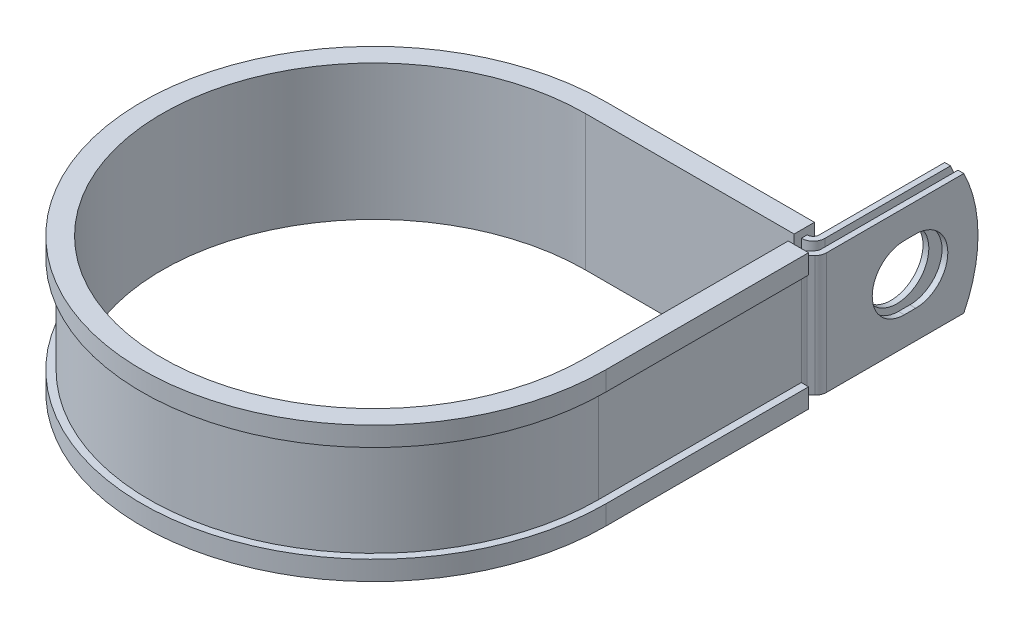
ISO-10303-21;
HEADER;
FILE_DESCRIPTION(('STEP AP214'),'2;1');
FILE_NAME('part.step','',(''),(''),'','','');
FILE_SCHEMA(('AUTOMOTIVE_DESIGN { 1 0 10303 214 1 1 1 1 }'));
ENDSEC;
DATA;
#1=APPLICATION_CONTEXT('core data for automotive mechanical design processes');
#2=APPLICATION_PROTOCOL_DEFINITION('international standard','automotive_design',2000,#1);
#3=PRODUCT_CONTEXT('',#1,'mechanical');
#4=PRODUCT('Part','Part','',(#3));
#5=PRODUCT_RELATED_PRODUCT_CATEGORY('part','',(#4));
#6=PRODUCT_DEFINITION_FORMATION('','',#4);
#7=PRODUCT_DEFINITION_CONTEXT('part definition',#1,'design');
#8=PRODUCT_DEFINITION('design','',#6,#7);
#9=PRODUCT_DEFINITION_SHAPE('','',#8);
#10=(LENGTH_UNIT() NAMED_UNIT(*) SI_UNIT(.MILLI.,.METRE.));
#11=(NAMED_UNIT(*) PLANE_ANGLE_UNIT() SI_UNIT($,.RADIAN.));
#12=(NAMED_UNIT(*) SI_UNIT($,.STERADIAN.) SOLID_ANGLE_UNIT());
#13=UNCERTAINTY_MEASURE_WITH_UNIT(LENGTH_MEASURE(1.E-05),#10,'distance_accuracy_value','');
#14=(GEOMETRIC_REPRESENTATION_CONTEXT(3) GLOBAL_UNCERTAINTY_ASSIGNED_CONTEXT((#13)) GLOBAL_UNIT_ASSIGNED_CONTEXT((#10,
#11,#12)) REPRESENTATION_CONTEXT('',''));
#15=CARTESIAN_POINT('',(0.,0.,0.));
#16=DIRECTION('',(0.,0.,1.));
#17=DIRECTION('',(1.,0.,0.));
#18=AXIS2_PLACEMENT_3D('',#15,#16,#17);
#19=CARTESIAN_POINT('',(46.6522698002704,-12.7,-45.974));
#20=DIRECTION('',(0.,1.,0.));
#21=DIRECTION('',(1.,0.,0.));
#22=AXIS2_PLACEMENT_3D('',#19,#20,#21);
#23=PLANE('',#22);
#24=DIRECTION('',(0.,0.,-1.));
#25=VECTOR('',#24,1.);
#26=CARTESIAN_POINT('',(43.8074698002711,-12.7,-45.974));
#27=LINE('',#26,#25);
#28=CARTESIAN_POINT('',(43.8074698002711,-12.7,-45.974));
#29=VERTEX_POINT('',#28);
#30=CARTESIAN_POINT('',(43.8074698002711,-12.7,-47.1932));
#31=VERTEX_POINT('',#30);
#32=EDGE_CURVE('E524',#29,#31,#27,.T.);
#33=ORIENTED_EDGE('',*,*,#32,.T.);
#34=DIRECTION('',(1.,0.,0.));
#35=VECTOR('',#34,1.);
#36=CARTESIAN_POINT('',(0.,-12.7,-47.1932));
#37=LINE('',#36,#35);
#38=CARTESIAN_POINT('',(43.8582698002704,-12.7,-47.1932));
#39=VERTEX_POINT('',#38);
#40=EDGE_CURVE('E411',#39,#31,#37,.F.);
#41=ORIENTED_EDGE('',*,*,#40,.F.);
#42=CARTESIAN_POINT('',(43.8582698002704,-12.7,-48.4124));
#43=DIRECTION('',(0.,1.,0.));
#44=DIRECTION('',(1.,0.,0.));
#45=AXIS2_PLACEMENT_3D('',#42,#43,#44);
#46=CIRCLE('',#45,1.2192);
#47=CARTESIAN_POINT('',(45.0774698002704,-12.7,-48.4124));
#48=VERTEX_POINT('',#47);
#49=EDGE_CURVE('E409',#48,#39,#46,.F.);
#50=ORIENTED_EDGE('',*,*,#49,.F.);
#51=DIRECTION('',(0.,0.,1.));
#52=VECTOR('',#51,1.);
#53=CARTESIAN_POINT('',(45.0774698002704,-12.7,-77.7748));
#54=LINE('',#53,#52);
#55=CARTESIAN_POINT('',(45.0774698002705,-12.7,-74.7974683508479));
#56=VERTEX_POINT('',#55);
#57=EDGE_CURVE('E407',#56,#48,#54,.T.);
#58=ORIENTED_EDGE('',*,*,#57,.F.);
#59=DIRECTION('',(-1.,0.,0.));
#60=VECTOR('',#59,1.);
#61=CARTESIAN_POINT('',(49.0906698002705,-12.7,-74.7974683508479));
#62=LINE('',#61,#60);
#63=CARTESIAN_POINT('',(46.2966698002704,-12.7,-74.7974683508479));
#64=VERTEX_POINT('',#63);
#65=EDGE_CURVE('E12',#64,#56,#62,.T.);
#66=ORIENTED_EDGE('',*,*,#65,.F.);
#67=DIRECTION('',(0.,0.,1.));
#68=VECTOR('',#67,1.);
#69=CARTESIAN_POINT('',(46.2966698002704,-12.7,-77.7748));
#70=LINE('',#69,#68);
#71=CARTESIAN_POINT('',(46.2966698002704,-12.7,-48.4124));
#72=VERTEX_POINT('',#71);
#73=EDGE_CURVE('E405',#64,#72,#70,.T.);
#74=ORIENTED_EDGE('',*,*,#73,.T.);
#75=CARTESIAN_POINT('',(43.8582698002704,-12.7,-48.4124));
#76=DIRECTION('',(0.,-1.,0.));
#77=DIRECTION('',(0.,0.,1.));
#78=AXIS2_PLACEMENT_3D('',#75,#76,#77);
#79=CIRCLE('',#78,2.4384);
#80=CARTESIAN_POINT('',(43.8582698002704,-12.7,-45.974));
#81=VERTEX_POINT('',#80);
#82=EDGE_CURVE('E402',#72,#81,#79,.T.);
#83=ORIENTED_EDGE('',*,*,#82,.T.);
#84=DIRECTION('',(-1.,0.,0.));
#85=VECTOR('',#84,1.);
#86=CARTESIAN_POINT('',(0.,-12.7,-45.974));
#87=LINE('',#86,#85);
#88=EDGE_CURVE('E399',#81,#29,#87,.T.);
#89=ORIENTED_EDGE('',*,*,#88,.T.);
#90=EDGE_LOOP('',(#33,#41,#50,#58,#66,#74,#83,#89));
#91=FACE_BOUND('',#90,.T.);
#92=ADVANCED_FACE('F55',(#91),#23,.F.);
#93=CARTESIAN_POINT('',(46.6522698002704,12.7,-45.974));
#94=DIRECTION('',(0.,1.,0.));
#95=DIRECTION('',(1.,0.,0.));
#96=AXIS2_PLACEMENT_3D('',#93,#94,#95);
#97=PLANE('',#96);
#98=DIRECTION('',(1.,0.,0.));
#99=VECTOR('',#98,1.);
#100=CARTESIAN_POINT('',(0.,12.7,-47.1932));
#101=LINE('',#100,#99);
#102=CARTESIAN_POINT('',(43.8582698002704,12.7,-47.1932));
#103=VERTEX_POINT('',#102);
#104=CARTESIAN_POINT('',(43.8074698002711,12.7,-47.1932));
#105=VERTEX_POINT('',#104);
#106=EDGE_CURVE('E369',#103,#105,#101,.F.);
#107=ORIENTED_EDGE('',*,*,#106,.T.);
#108=DIRECTION('',(0.,0.,1.));
#109=VECTOR('',#108,1.);
#110=CARTESIAN_POINT('',(43.8074698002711,12.7,-47.1932));
#111=LINE('',#110,#109);
#112=CARTESIAN_POINT('',(43.8074698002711,12.7,-45.974));
#113=VERTEX_POINT('',#112);
#114=EDGE_CURVE('E518',#105,#113,#111,.T.);
#115=ORIENTED_EDGE('',*,*,#114,.T.);
#116=DIRECTION('',(-1.,0.,0.));
#117=VECTOR('',#116,1.);
#118=CARTESIAN_POINT('',(0.,12.7,-45.974));
#119=LINE('',#118,#117);
#120=CARTESIAN_POINT('',(43.8582698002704,12.7,-45.974));
#121=VERTEX_POINT('',#120);
#122=EDGE_CURVE('E626',#121,#113,#119,.T.);
#123=ORIENTED_EDGE('',*,*,#122,.F.);
#124=CARTESIAN_POINT('',(43.8582698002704,12.7,-48.4124));
#125=DIRECTION('',(0.,-1.,0.));
#126=DIRECTION('',(0.,0.,1.));
#127=AXIS2_PLACEMENT_3D('',#124,#125,#126);
#128=CIRCLE('',#127,2.4384);
#129=CARTESIAN_POINT('',(46.2966698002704,12.7,-48.4124));
#130=VERTEX_POINT('',#129);
#131=EDGE_CURVE('E371',#130,#121,#128,.T.);
#132=ORIENTED_EDGE('',*,*,#131,.F.);
#133=DIRECTION('',(0.,0.,1.));
#134=VECTOR('',#133,1.);
#135=CARTESIAN_POINT('',(46.2966698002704,12.7,-77.7748));
#136=LINE('',#135,#134);
#137=CARTESIAN_POINT('',(46.2966698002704,12.7,-74.7974683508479));
#138=VERTEX_POINT('',#137);
#139=EDGE_CURVE('E362',#138,#130,#136,.T.);
#140=ORIENTED_EDGE('',*,*,#139,.F.);
#141=DIRECTION('',(-1.,0.,0.));
#142=VECTOR('',#141,1.);
#143=CARTESIAN_POINT('',(49.0906698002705,12.7,-74.7974683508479));
#144=LINE('',#143,#142);
#145=CARTESIAN_POINT('',(45.0774698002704,12.7,-74.7974683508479));
#146=VERTEX_POINT('',#145);
#147=EDGE_CURVE('E63',#138,#146,#144,.T.);
#148=ORIENTED_EDGE('',*,*,#147,.T.);
#149=DIRECTION('',(0.,0.,1.));
#150=VECTOR('',#149,1.);
#151=CARTESIAN_POINT('',(45.0774698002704,12.7,-77.7748));
#152=LINE('',#151,#150);
#153=CARTESIAN_POINT('',(45.0774698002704,12.7,-48.4124));
#154=VERTEX_POINT('',#153);
#155=EDGE_CURVE('E359',#146,#154,#152,.T.);
#156=ORIENTED_EDGE('',*,*,#155,.T.);
#157=CARTESIAN_POINT('',(43.8582698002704,12.7,-48.4124));
#158=DIRECTION('',(0.,1.,0.));
#159=DIRECTION('',(1.,0.,0.));
#160=AXIS2_PLACEMENT_3D('',#157,#158,#159);
#161=CIRCLE('',#160,1.2192);
#162=EDGE_CURVE('E367',#154,#103,#161,.F.);
#163=ORIENTED_EDGE('',*,*,#162,.T.);
#164=EDGE_LOOP('',(#107,#115,#123,#132,#140,#148,#156,#163));
#165=FACE_BOUND('',#164,.T.);
#166=ADVANCED_FACE('F358',(#165),#97,.T.);
#167=CARTESIAN_POINT('',(0.,12.7,-45.974));
#168=DIRECTION('',(0.,0.,1.));
#169=DIRECTION('',(1.,0.,0.));
#170=AXIS2_PLACEMENT_3D('',#167,#168,#169);
#171=PLANE('',#170);
#172=ORIENTED_EDGE('',*,*,#122,.T.);
#173=DIRECTION('',(0.,-1.,0.));
#174=VECTOR('',#173,1.);
#175=CARTESIAN_POINT('',(43.8074698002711,12.7,-45.974));
#176=LINE('',#175,#174);
#177=EDGE_CURVE('E521',#113,#29,#176,.T.);
#178=ORIENTED_EDGE('',*,*,#177,.T.);
#179=ORIENTED_EDGE('',*,*,#88,.F.);
#180=DIRECTION('',(0.,-1.,0.));
#181=VECTOR('',#180,1.);
#182=CARTESIAN_POINT('',(43.8582698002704,12.7,-45.974));
#183=LINE('',#182,#181);
#184=EDGE_CURVE('E345',#121,#81,#183,.T.);
#185=ORIENTED_EDGE('',*,*,#184,.F.);
#186=EDGE_LOOP('',(#172,#178,#179,#185));
#187=FACE_BOUND('',#186,.T.);
#188=ADVANCED_FACE('F636',(#187),#171,.T.);
#189=CARTESIAN_POINT('',(49.0906698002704,12.7,-45.974));
#190=DIRECTION('',(-1.,0.,0.));
#191=DIRECTION('',(0.,0.,1.));
#192=AXIS2_PLACEMENT_3D('',#189,#190,#191);
#193=PLANE('',#192);
#194=CARTESIAN_POINT('',(49.0906698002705,0.,-64.6937999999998));
#195=DIRECTION('',(1.,0.,0.));
#196=DIRECTION('',(0.,0.,-1.));
#197=AXIS2_PLACEMENT_3D('',#194,#195,#196);
#198=CIRCLE('',#197,6.7437);
#199=CARTESIAN_POINT('',(49.0906698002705,-6.7437,-64.6938000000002));
#200=VERTEX_POINT('',#199);
#201=CARTESIAN_POINT('',(49.0906698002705,6.7437,-64.6938000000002));
#202=VERTEX_POINT('',#201);
#203=EDGE_CURVE('E581',#200,#202,#198,.T.);
#204=ORIENTED_EDGE('',*,*,#203,.F.);
#205=DIRECTION('',(0.,0.,-1.));
#206=VECTOR('',#205,1.);
#207=CARTESIAN_POINT('',(49.0906698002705,-6.7437,-62.3061999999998));
#208=LINE('',#207,#206);
#209=CARTESIAN_POINT('',(49.0906698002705,-6.7437,-62.3061999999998));
#210=VERTEX_POINT('',#209);
#211=EDGE_CURVE('E584',#210,#200,#208,.T.);
#212=ORIENTED_EDGE('',*,*,#211,.F.);
#213=CARTESIAN_POINT('',(49.0906698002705,0.,-62.3061999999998));
#214=DIRECTION('',(1.,0.,0.));
#215=DIRECTION('',(0.,0.,-1.));
#216=AXIS2_PLACEMENT_3D('',#213,#214,#215);
#217=CIRCLE('',#216,6.7437);
#218=CARTESIAN_POINT('',(49.0906698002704,6.7437,-62.3061999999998));
#219=VERTEX_POINT('',#218);
#220=EDGE_CURVE('E577',#219,#210,#217,.T.);
#221=ORIENTED_EDGE('',*,*,#220,.F.);
#222=DIRECTION('',(0.,0.,1.));
#223=VECTOR('',#222,1.);
#224=CARTESIAN_POINT('',(49.0906698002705,6.7437,-62.3061999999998));
#225=LINE('',#224,#223);
#226=EDGE_CURVE('E578',#202,#219,#225,.T.);
#227=ORIENTED_EDGE('',*,*,#226,.F.);
#228=EDGE_LOOP('',(#204,#212,#221,#227));
#229=FACE_BOUND('',#228,.T.);
#230=DIRECTION('',(0.,0.,-1.));
#231=VECTOR('',#230,1.);
#232=CARTESIAN_POINT('',(49.0906698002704,-12.7,-45.974));
#233=LINE('',#232,#231);
#234=CARTESIAN_POINT('',(49.0906698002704,-12.7,-45.974));
#235=VERTEX_POINT('',#234);
#236=CARTESIAN_POINT('',(49.0906698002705,-12.7,-74.7974683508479));
#237=VERTEX_POINT('',#236);
#238=EDGE_CURVE('E383',#235,#237,#233,.T.);
#239=ORIENTED_EDGE('',*,*,#238,.T.);
#240=CARTESIAN_POINT('',(49.0906698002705,0.,-49.1998));
#241=DIRECTION('',(-1.,0.,0.));
#242=DIRECTION('',(0.,0.,1.));
#243=AXIS2_PLACEMENT_3D('',#240,#241,#242);
#244=CIRCLE('',#243,28.575);
#245=CARTESIAN_POINT('',(49.0906698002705,12.7,-74.7974683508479));
#246=VERTEX_POINT('',#245);
#247=EDGE_CURVE('E569',#246,#237,#244,.T.);
#248=ORIENTED_EDGE('',*,*,#247,.F.);
#249=DIRECTION('',(0.,0.,-1.));
#250=VECTOR('',#249,1.);
#251=CARTESIAN_POINT('',(49.0906698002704,12.7,-45.974));
#252=LINE('',#251,#250);
#253=CARTESIAN_POINT('',(49.0906698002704,12.7,-45.974));
#254=VERTEX_POINT('',#253);
#255=EDGE_CURVE('E420',#254,#246,#252,.T.);
#256=ORIENTED_EDGE('',*,*,#255,.F.);
#257=DIRECTION('',(0.,-1.,0.));
#258=VECTOR('',#257,1.);
#259=CARTESIAN_POINT('',(49.0906698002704,12.7,-45.974));
#260=LINE('',#259,#258);
#261=EDGE_CURVE('E382',#254,#235,#260,.T.);
#262=ORIENTED_EDGE('',*,*,#261,.T.);
#263=EDGE_LOOP('',(#239,#248,#256,#262));
#264=FACE_BOUND('',#263,.T.);
#265=ADVANCED_FACE('F57',(#229,#264),#193,.F.);
#266=CARTESIAN_POINT('',(47.8714698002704,12.7,-45.974));
#267=DIRECTION('',(-1.,0.,0.));
#268=DIRECTION('',(0.,0.,1.));
#269=AXIS2_PLACEMENT_3D('',#266,#267,#268);
#270=PLANE('',#269);
#271=DIRECTION('',(0.,0.,-1.));
#272=VECTOR('',#271,1.);
#273=CARTESIAN_POINT('',(47.8714698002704,-6.7437,-62.3061999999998));
#274=LINE('',#273,#272);
#275=CARTESIAN_POINT('',(47.8714698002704,-6.7437,-62.3061999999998));
#276=VERTEX_POINT('',#275);
#277=CARTESIAN_POINT('',(47.8714698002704,-6.7437,-64.6938000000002));
#278=VERTEX_POINT('',#277);
#279=EDGE_CURVE('E580',#276,#278,#274,.T.);
#280=ORIENTED_EDGE('',*,*,#279,.T.);
#281=CARTESIAN_POINT('',(47.8714698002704,0.,-64.6937999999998));
#282=DIRECTION('',(-1.,0.,0.));
#283=DIRECTION('',(0.,0.,1.));
#284=AXIS2_PLACEMENT_3D('',#281,#282,#283);
#285=CIRCLE('',#284,6.7437);
#286=CARTESIAN_POINT('',(47.8714698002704,6.7437,-64.6938000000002));
#287=VERTEX_POINT('',#286);
#288=EDGE_CURVE('E601',#278,#287,#285,.F.);
#289=ORIENTED_EDGE('',*,*,#288,.T.);
#290=DIRECTION('',(0.,0.,1.));
#291=VECTOR('',#290,1.);
#292=CARTESIAN_POINT('',(47.8714698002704,6.7437,-62.3061999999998));
#293=LINE('',#292,#291);
#294=CARTESIAN_POINT('',(47.8714698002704,6.7437,-62.3061999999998));
#295=VERTEX_POINT('',#294);
#296=EDGE_CURVE('E597',#287,#295,#293,.T.);
#297=ORIENTED_EDGE('',*,*,#296,.T.);
#298=CARTESIAN_POINT('',(47.8714698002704,0.,-62.3061999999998));
#299=DIRECTION('',(-1.,0.,0.));
#300=DIRECTION('',(0.,0.,1.));
#301=AXIS2_PLACEMENT_3D('',#298,#299,#300);
#302=CIRCLE('',#301,6.7437);
#303=EDGE_CURVE('E592',#295,#276,#302,.F.);
#304=ORIENTED_EDGE('',*,*,#303,.T.);
#305=EDGE_LOOP('',(#280,#289,#297,#304));
#306=FACE_BOUND('',#305,.T.);
#307=CARTESIAN_POINT('',(47.8714698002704,0.,-49.1998));
#308=DIRECTION('',(-1.,0.,0.));
#309=DIRECTION('',(0.,0.,1.));
#310=AXIS2_PLACEMENT_3D('',#307,#308,#309);
#311=CIRCLE('',#310,28.575);
#312=CARTESIAN_POINT('',(47.8714698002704,12.7,-74.7974683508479));
#313=VERTEX_POINT('',#312);
#314=CARTESIAN_POINT('',(47.8714698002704,-12.7,-74.7974683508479));
#315=VERTEX_POINT('',#314);
#316=EDGE_CURVE('E77',#313,#315,#311,.T.);
#317=ORIENTED_EDGE('',*,*,#316,.T.);
#318=DIRECTION('',(0.,0.,-1.));
#319=VECTOR('',#318,1.);
#320=CARTESIAN_POINT('',(47.8714698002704,-12.7,-45.974));
#321=LINE('',#320,#319);
#322=CARTESIAN_POINT('',(47.8714698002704,-12.7,-45.974));
#323=VERTEX_POINT('',#322);
#324=EDGE_CURVE('E386',#323,#315,#321,.T.);
#325=ORIENTED_EDGE('',*,*,#324,.F.);
#326=DIRECTION('',(0.,-1.,0.));
#327=VECTOR('',#326,1.);
#328=CARTESIAN_POINT('',(47.8714698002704,12.7,-45.974));
#329=LINE('',#328,#327);
#330=CARTESIAN_POINT('',(47.8714698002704,12.7,-45.974));
#331=VERTEX_POINT('',#330);
#332=EDGE_CURVE('E353',#331,#323,#329,.T.);
#333=ORIENTED_EDGE('',*,*,#332,.F.);
#334=DIRECTION('',(0.,0.,-1.));
#335=VECTOR('',#334,1.);
#336=CARTESIAN_POINT('',(47.8714698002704,12.7,-45.974));
#337=LINE('',#336,#335);
#338=EDGE_CURVE('E616',#331,#313,#337,.T.);
#339=ORIENTED_EDGE('',*,*,#338,.T.);
#340=EDGE_LOOP('',(#317,#325,#333,#339));
#341=FACE_BOUND('',#340,.T.);
#342=ADVANCED_FACE('F690',(#306,#341),#270,.T.);
#343=CARTESIAN_POINT('',(46.2966698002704,12.7,-77.7748));
#344=DIRECTION('',(1.,0.,0.));
#345=DIRECTION('',(0.,0.,-1.));
#346=AXIS2_PLACEMENT_3D('',#343,#344,#345);
#347=PLANE('',#346);
#348=CARTESIAN_POINT('',(46.2966698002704,0.,-63.5));
#349=DIRECTION('',(1.,0.,0.));
#350=DIRECTION('',(0.,0.,-1.));
#351=AXIS2_PLACEMENT_3D('',#348,#349,#350);
#352=CIRCLE('',#351,6.74369999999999);
#353=CARTESIAN_POINT('',(46.2966698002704,0.,-70.2437));
#354=VERTEX_POINT('',#353);
#355=EDGE_CURVE('E387',#354,#354,#352,.F.);
#356=ORIENTED_EDGE('',*,*,#355,.T.);
#357=EDGE_LOOP('',(#356));
#358=FACE_BOUND('',#357,.T.);
#359=ORIENTED_EDGE('',*,*,#73,.F.);
#360=CARTESIAN_POINT('',(46.2966698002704,0.,-49.1998));
#361=DIRECTION('',(1.,0.,0.));
#362=DIRECTION('',(0.,0.,-1.));
#363=AXIS2_PLACEMENT_3D('',#360,#361,#362);
#364=CIRCLE('',#363,28.575);
#365=EDGE_CURVE('E574',#64,#138,#364,.T.);
#366=ORIENTED_EDGE('',*,*,#365,.T.);
#367=ORIENTED_EDGE('',*,*,#139,.T.);
#368=DIRECTION('',(0.,-1.,0.));
#369=VECTOR('',#368,1.);
#370=CARTESIAN_POINT('',(46.2966698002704,12.7,-48.4124));
#371=LINE('',#370,#369);
#372=EDGE_CURVE('E342',#130,#72,#371,.T.);
#373=ORIENTED_EDGE('',*,*,#372,.T.);
#374=EDGE_LOOP('',(#359,#366,#367,#373));
#375=FACE_BOUND('',#374,.T.);
#376=ADVANCED_FACE('F642',(#358,#375),#347,.T.);
#377=CARTESIAN_POINT('',(45.0774698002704,12.7,-77.7748));
#378=DIRECTION('',(1.,0.,0.));
#379=DIRECTION('',(0.,0.,-1.));
#380=AXIS2_PLACEMENT_3D('',#377,#378,#379);
#381=PLANE('',#380);
#382=CARTESIAN_POINT('',(45.0774698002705,0.,-63.5));
#383=DIRECTION('',(-1.,0.,0.));
#384=DIRECTION('',(0.,0.,1.));
#385=AXIS2_PLACEMENT_3D('',#382,#383,#384);
#386=CIRCLE('',#385,6.74369999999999);
#387=CARTESIAN_POINT('',(45.0774698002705,0.,-56.7563));
#388=VERTEX_POINT('',#387);
#389=EDGE_CURVE('E609',#388,#388,#386,.T.);
#390=ORIENTED_EDGE('',*,*,#389,.F.);
#391=EDGE_LOOP('',(#390));
#392=FACE_BOUND('',#391,.T.);
#393=CARTESIAN_POINT('',(45.0774698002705,0.,-49.1998));
#394=DIRECTION('',(-1.,0.,0.));
#395=DIRECTION('',(0.,0.,1.));
#396=AXIS2_PLACEMENT_3D('',#393,#394,#395);
#397=CIRCLE('',#396,28.575);
#398=EDGE_CURVE('E69',#146,#56,#397,.T.);
#399=ORIENTED_EDGE('',*,*,#398,.T.);
#400=ORIENTED_EDGE('',*,*,#57,.T.);
#401=DIRECTION('',(0.,-1.,0.));
#402=VECTOR('',#401,1.);
#403=CARTESIAN_POINT('',(45.0774698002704,12.7,-48.4124));
#404=LINE('',#403,#402);
#405=EDGE_CURVE('E339',#154,#48,#404,.T.);
#406=ORIENTED_EDGE('',*,*,#405,.F.);
#407=ORIENTED_EDGE('',*,*,#155,.F.);
#408=EDGE_LOOP('',(#399,#400,#406,#407));
#409=FACE_BOUND('',#408,.T.);
#410=ADVANCED_FACE('F365',(#392,#409),#381,.F.);
#411=CARTESIAN_POINT('',(48.4124,-12.7,-42.5615026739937));
#412=DIRECTION('',(0.,1.,0.));
#413=DIRECTION('',(1.,0.,0.));
#414=AXIS2_PLACEMENT_3D('',#411,#412,#413);
#415=CIRCLE('',#414,1.2192);
#416=CARTESIAN_POINT('',(47.1932,-12.7,-42.5615026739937));
#417=VERTEX_POINT('',#416);
#418=CARTESIAN_POINT('',(47.5502954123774,-12.7,-43.4236072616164));
#419=VERTEX_POINT('',#418);
#420=EDGE_CURVE('E414',#417,#419,#415,.F.);
#421=ORIENTED_EDGE('',*,*,#420,.F.);
#422=DIRECTION('',(1.,0.,0.));
#423=VECTOR('',#422,1.);
#424=CARTESIAN_POINT('',(45.974,-12.7,-42.5615026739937));
#425=LINE('',#424,#423);
#426=CARTESIAN_POINT('',(45.974,-12.7,-42.5615026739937));
#427=VERTEX_POINT('',#426);
#428=EDGE_CURVE('E452',#427,#417,#425,.T.);
#429=ORIENTED_EDGE('',*,*,#428,.F.);
#430=CARTESIAN_POINT('',(48.4124,-12.7,-42.5615026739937));
#431=DIRECTION('',(0.,-1.,0.));
#432=DIRECTION('',(0.,0.,1.));
#433=AXIS2_PLACEMENT_3D('',#430,#431,#432);
#434=CIRCLE('',#433,2.4384);
#435=CARTESIAN_POINT('',(46.6881908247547,-12.7,-44.285711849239));
#436=VERTEX_POINT('',#435);
#437=EDGE_CURVE('E396',#427,#436,#434,.T.);
#438=ORIENTED_EDGE('',*,*,#437,.T.);
#439=DIRECTION('',(0.707106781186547,0.,-0.707106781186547));
#440=VECTOR('',#439,1.);
#441=CARTESIAN_POINT('',(46.6881908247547,-12.7,-44.285711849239));
#442=LINE('',#441,#440);
#443=CARTESIAN_POINT('',(47.5143743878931,-12.7,-45.1118954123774));
#444=VERTEX_POINT('',#443);
#445=EDGE_CURVE('E393',#436,#444,#442,.T.);
#446=ORIENTED_EDGE('',*,*,#445,.T.);
#447=CARTESIAN_POINT('',(46.6522698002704,-12.7,-45.974));
#448=DIRECTION('',(0.,1.,0.));
#449=DIRECTION('',(0.,0.,1.));
#450=AXIS2_PLACEMENT_3D('',#447,#448,#449);
#451=CIRCLE('',#450,1.2192);
#452=EDGE_CURVE('E390',#444,#323,#451,.T.);
#453=ORIENTED_EDGE('',*,*,#452,.T.);
#454=ORIENTED_EDGE('',*,*,#324,.T.);
#455=DIRECTION('',(-1.,0.,0.));
#456=VECTOR('',#455,1.);
#457=CARTESIAN_POINT('',(49.0906698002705,-12.7,-74.7974683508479));
#458=LINE('',#457,#456);
#459=EDGE_CURVE('E567',#237,#315,#458,.T.);
#460=ORIENTED_EDGE('',*,*,#459,.F.);
#461=ORIENTED_EDGE('',*,*,#238,.F.);
#462=CARTESIAN_POINT('',(46.6522698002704,-12.7,-45.974));
#463=DIRECTION('',(0.,1.,0.));
#464=DIRECTION('',(1.,0.,0.));
#465=AXIS2_PLACEMENT_3D('',#462,#463,#464);
#466=CIRCLE('',#465,2.4384);
#467=CARTESIAN_POINT('',(48.3764789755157,-12.7,-44.2497908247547));
#468=VERTEX_POINT('',#467);
#469=EDGE_CURVE('E418',#468,#235,#466,.T.);
#470=ORIENTED_EDGE('',*,*,#469,.F.);
#471=DIRECTION('',(0.707106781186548,0.,-0.707106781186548));
#472=VECTOR('',#471,1.);
#473=CARTESIAN_POINT('',(47.5502954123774,-12.7,-43.4236072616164));
#474=LINE('',#473,#472);
#475=EDGE_CURVE('E416',#419,#468,#474,.T.);
#476=ORIENTED_EDGE('',*,*,#475,.F.);
#477=EDGE_LOOP('',(#421,#429,#438,#446,#453,#454,#460,#461,#470,#476));
#478=FACE_BOUND('',#477,.T.);
#479=ADVANCED_FACE('F676',(#478),#23,.F.);
#480=DIRECTION('',(-1.,0.,0.));
#481=VECTOR('',#480,1.);
#482=CARTESIAN_POINT('',(47.1932,12.7,-42.5615026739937));
#483=LINE('',#482,#481);
#484=CARTESIAN_POINT('',(47.1932,12.7,-42.5615026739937));
#485=VERTEX_POINT('',#484);
#486=CARTESIAN_POINT('',(45.974,12.7,-42.5615026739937));
#487=VERTEX_POINT('',#486);
#488=EDGE_CURVE('E441',#485,#487,#483,.T.);
#489=ORIENTED_EDGE('',*,*,#488,.F.);
#490=CARTESIAN_POINT('',(48.4124,12.7,-42.5615026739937));
#491=DIRECTION('',(0.,1.,0.));
#492=DIRECTION('',(1.,0.,0.));
#493=AXIS2_PLACEMENT_3D('',#490,#491,#492);
#494=CIRCLE('',#493,1.2192);
#495=CARTESIAN_POINT('',(47.5502954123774,12.7,-43.4236072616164));
#496=VERTEX_POINT('',#495);
#497=EDGE_CURVE('E376',#485,#496,#494,.F.);
#498=ORIENTED_EDGE('',*,*,#497,.T.);
#499=DIRECTION('',(0.707106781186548,0.,-0.707106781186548));
#500=VECTOR('',#499,1.);
#501=CARTESIAN_POINT('',(47.5502954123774,12.7,-43.4236072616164));
#502=LINE('',#501,#500);
#503=CARTESIAN_POINT('',(48.3764789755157,12.7,-44.2497908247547));
#504=VERTEX_POINT('',#503);
#505=EDGE_CURVE('E378',#496,#504,#502,.T.);
#506=ORIENTED_EDGE('',*,*,#505,.T.);
#507=CARTESIAN_POINT('',(46.6522698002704,12.7,-45.974));
#508=DIRECTION('',(0.,1.,0.));
#509=DIRECTION('',(1.,0.,0.));
#510=AXIS2_PLACEMENT_3D('',#507,#508,#509);
#511=CIRCLE('',#510,2.4384);
#512=EDGE_CURVE('E380',#504,#254,#511,.T.);
#513=ORIENTED_EDGE('',*,*,#512,.T.);
#514=ORIENTED_EDGE('',*,*,#255,.T.);
#515=DIRECTION('',(-1.,0.,0.));
#516=VECTOR('',#515,1.);
#517=CARTESIAN_POINT('',(49.0906698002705,12.7,-74.7974683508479));
#518=LINE('',#517,#516);
#519=EDGE_CURVE('E571',#246,#313,#518,.T.);
#520=ORIENTED_EDGE('',*,*,#519,.T.);
#521=ORIENTED_EDGE('',*,*,#338,.F.);
#522=CARTESIAN_POINT('',(46.6522698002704,12.7,-45.974));
#523=DIRECTION('',(0.,1.,0.));
#524=DIRECTION('',(0.,0.,1.));
#525=AXIS2_PLACEMENT_3D('',#522,#523,#524);
#526=CIRCLE('',#525,1.2192);
#527=CARTESIAN_POINT('',(47.5143743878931,12.7,-45.1118954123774));
#528=VERTEX_POINT('',#527);
#529=EDGE_CURVE('E619',#528,#331,#526,.T.);
#530=ORIENTED_EDGE('',*,*,#529,.F.);
#531=DIRECTION('',(0.707106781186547,0.,-0.707106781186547));
#532=VECTOR('',#531,1.);
#533=CARTESIAN_POINT('',(46.6881908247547,12.7,-44.285711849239));
#534=LINE('',#533,#532);
#535=CARTESIAN_POINT('',(46.6881908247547,12.7,-44.285711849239));
#536=VERTEX_POINT('',#535);
#537=EDGE_CURVE('E622',#536,#528,#534,.T.);
#538=ORIENTED_EDGE('',*,*,#537,.F.);
#539=CARTESIAN_POINT('',(48.4124,12.7,-42.5615026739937));
#540=DIRECTION('',(0.,-1.,0.));
#541=DIRECTION('',(0.,0.,1.));
#542=AXIS2_PLACEMENT_3D('',#539,#540,#541);
#543=CIRCLE('',#542,2.4384);
#544=EDGE_CURVE('E451',#487,#536,#543,.T.);
#545=ORIENTED_EDGE('',*,*,#544,.F.);
#546=EDGE_LOOP('',(#489,#498,#506,#513,#514,#520,#521,#530,#538,#545));
#547=FACE_BOUND('',#546,.T.);
#548=ADVANCED_FACE('F448',(#547),#97,.T.);
#549=CARTESIAN_POINT('',(46.6522698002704,12.7,-45.974));
#550=DIRECTION('',(0.,-1.,0.));
#551=DIRECTION('',(0.,0.,-1.));
#552=AXIS2_PLACEMENT_3D('',#549,#550,#551);
#553=CYLINDRICAL_SURFACE('',#552,1.2192);
#554=ORIENTED_EDGE('',*,*,#452,.F.);
#555=DIRECTION('',(0.,-1.,0.));
#556=VECTOR('',#555,1.);
#557=CARTESIAN_POINT('',(47.5143743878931,12.7,-45.1118954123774));
#558=LINE('',#557,#556);
#559=EDGE_CURVE('E351',#528,#444,#558,.T.);
#560=ORIENTED_EDGE('',*,*,#559,.F.);
#561=ORIENTED_EDGE('',*,*,#529,.T.);
#562=ORIENTED_EDGE('',*,*,#332,.T.);
#563=EDGE_LOOP('',(#554,#560,#561,#562));
#564=FACE_BOUND('',#563,.T.);
#565=ADVANCED_FACE('F686',(#564),#553,.F.);
#566=CARTESIAN_POINT('',(46.6881908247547,12.7,-44.285711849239));
#567=DIRECTION('',(-0.707106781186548,0.,-0.707106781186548));
#568=DIRECTION('',(-0.707106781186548,0.,0.707106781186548));
#569=AXIS2_PLACEMENT_3D('',#566,#567,#568);
#570=PLANE('',#569);
#571=ORIENTED_EDGE('',*,*,#445,.F.);
#572=DIRECTION('',(0.,-1.,0.));
#573=VECTOR('',#572,1.);
#574=CARTESIAN_POINT('',(46.6881908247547,12.7,-44.285711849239));
#575=LINE('',#574,#573);
#576=EDGE_CURVE('E349',#536,#436,#575,.T.);
#577=ORIENTED_EDGE('',*,*,#576,.F.);
#578=ORIENTED_EDGE('',*,*,#537,.T.);
#579=ORIENTED_EDGE('',*,*,#559,.T.);
#580=EDGE_LOOP('',(#571,#577,#578,#579));
#581=FACE_BOUND('',#580,.T.);
#582=ADVANCED_FACE('F681',(#581),#570,.T.);
#583=CARTESIAN_POINT('',(48.4124,12.7,-42.5615026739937));
#584=DIRECTION('',(0.,-1.,0.));
#585=DIRECTION('',(0.,0.,-1.));
#586=AXIS2_PLACEMENT_3D('',#583,#584,#585);
#587=CYLINDRICAL_SURFACE('',#586,2.4384);
#588=ORIENTED_EDGE('',*,*,#437,.F.);
#589=DIRECTION('',(0.,-1.,0.));
#590=VECTOR('',#589,1.);
#591=CARTESIAN_POINT('',(45.974,12.7,-42.5615026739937));
#592=LINE('',#591,#590);
#593=EDGE_CURVE('E347',#487,#427,#592,.T.);
#594=ORIENTED_EDGE('',*,*,#593,.F.);
#595=ORIENTED_EDGE('',*,*,#544,.T.);
#596=ORIENTED_EDGE('',*,*,#576,.T.);
#597=EDGE_LOOP('',(#588,#594,#595,#596));
#598=FACE_BOUND('',#597,.T.);
#599=ADVANCED_FACE('F678',(#598),#587,.T.);
#600=CARTESIAN_POINT('',(43.8582698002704,12.7,-48.4124));
#601=DIRECTION('',(0.,-1.,0.));
#602=DIRECTION('',(0.,0.,-1.));
#603=AXIS2_PLACEMENT_3D('',#600,#601,#602);
#604=CYLINDRICAL_SURFACE('',#603,2.4384);
#605=ORIENTED_EDGE('',*,*,#82,.F.);
#606=ORIENTED_EDGE('',*,*,#372,.F.);
#607=ORIENTED_EDGE('',*,*,#131,.T.);
#608=ORIENTED_EDGE('',*,*,#184,.T.);
#609=EDGE_LOOP('',(#605,#606,#607,#608));
#610=FACE_BOUND('',#609,.T.);
#611=ADVANCED_FACE('F632',(#610),#604,.T.);
#612=CARTESIAN_POINT('',(43.8582698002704,12.7,-48.4124));
#613=DIRECTION('',(0.,-1.,0.));
#614=DIRECTION('',(0.,0.,-1.));
#615=AXIS2_PLACEMENT_3D('',#612,#613,#614);
#616=CYLINDRICAL_SURFACE('',#615,1.2192);
#617=ORIENTED_EDGE('',*,*,#49,.T.);
#618=DIRECTION('',(0.,-1.,0.));
#619=VECTOR('',#618,1.);
#620=CARTESIAN_POINT('',(43.8582698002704,12.7,-47.1932));
#621=LINE('',#620,#619);
#622=EDGE_CURVE('E330',#103,#39,#621,.T.);
#623=ORIENTED_EDGE('',*,*,#622,.F.);
#624=ORIENTED_EDGE('',*,*,#162,.F.);
#625=ORIENTED_EDGE('',*,*,#405,.T.);
#626=EDGE_LOOP('',(#617,#623,#624,#625));
#627=FACE_BOUND('',#626,.T.);
#628=ADVANCED_FACE('F647',(#627),#616,.F.);
#629=CARTESIAN_POINT('',(0.,12.7,-47.1932));
#630=DIRECTION('',(0.,0.,1.));
#631=DIRECTION('',(1.,0.,0.));
#632=AXIS2_PLACEMENT_3D('',#629,#630,#631);
#633=PLANE('',#632);
#634=DIRECTION('',(0.,-1.,0.));
#635=VECTOR('',#634,1.);
#636=CARTESIAN_POINT('',(0.,12.7,-47.1932));
#637=LINE('',#636,#635);
#638=CARTESIAN_POINT('',(6.61986458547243E-13,10.16,-47.1932));
#639=VERTEX_POINT('',#638);
#640=CARTESIAN_POINT('',(6.61986458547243E-13,-10.16,-47.1932));
#641=VERTEX_POINT('',#640);
#642=EDGE_CURVE('E321',#639,#641,#637,.T.);
#643=ORIENTED_EDGE('',*,*,#642,.F.);
#644=DIRECTION('',(1.,0.,0.));
#645=VECTOR('',#644,1.);
#646=CARTESIAN_POINT('',(6.61986458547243E-13,10.16,-47.1932));
#647=LINE('',#646,#645);
#648=CARTESIAN_POINT('',(43.8074698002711,10.16,-47.1932));
#649=VERTEX_POINT('',#648);
#650=EDGE_CURVE('E564',#639,#649,#647,.T.);
#651=ORIENTED_EDGE('',*,*,#650,.T.);
#652=DIRECTION('',(0.,1.,0.));
#653=VECTOR('',#652,1.);
#654=CARTESIAN_POINT('',(43.8074698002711,12.7,-47.1932));
#655=LINE('',#654,#653);
#656=EDGE_CURVE('E515',#649,#105,#655,.T.);
#657=ORIENTED_EDGE('',*,*,#656,.T.);
#658=ORIENTED_EDGE('',*,*,#106,.F.);
#659=ORIENTED_EDGE('',*,*,#622,.T.);
#660=ORIENTED_EDGE('',*,*,#40,.T.);
#661=DIRECTION('',(0.,1.,0.));
#662=VECTOR('',#661,1.);
#663=CARTESIAN_POINT('',(43.8074698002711,-12.7,-47.1932));
#664=LINE('',#663,#662);
#665=CARTESIAN_POINT('',(43.8074698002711,-10.16,-47.1932));
#666=VERTEX_POINT('',#665);
#667=EDGE_CURVE('E527',#31,#666,#664,.T.);
#668=ORIENTED_EDGE('',*,*,#667,.T.);
#669=DIRECTION('',(1.,0.,0.));
#670=VECTOR('',#669,1.);
#671=CARTESIAN_POINT('',(6.61986458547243E-13,-10.16,-47.1932));
#672=LINE('',#671,#670);
#673=EDGE_CURVE('E544',#641,#666,#672,.T.);
#674=ORIENTED_EDGE('',*,*,#673,.F.);
#675=EDGE_LOOP('',(#643,#651,#657,#658,#659,#660,#668,#674));
#676=FACE_BOUND('',#675,.T.);
#677=ADVANCED_FACE('F651',(#676),#633,.F.);
#678=CARTESIAN_POINT('',(0.,12.7,0.));
#679=DIRECTION('',(0.,-1.,0.));
#680=DIRECTION('',(0.,0.,-1.));
#681=AXIS2_PLACEMENT_3D('',#678,#679,#680);
#682=CYLINDRICAL_SURFACE('',#681,47.1932);
#683=DIRECTION('',(0.,-1.,0.));
#684=VECTOR('',#683,1.);
#685=CARTESIAN_POINT('',(47.1932,12.7,0.));
#686=LINE('',#685,#684);
#687=CARTESIAN_POINT('',(47.1932,10.16,0.));
#688=VERTEX_POINT('',#687);
#689=CARTESIAN_POINT('',(47.1932,-10.16,0.));
#690=VERTEX_POINT('',#689);
#691=EDGE_CURVE('E319',#688,#690,#686,.T.);
#692=ORIENTED_EDGE('',*,*,#691,.F.);
#693=CARTESIAN_POINT('',(0.,10.16,0.));
#694=DIRECTION('',(0.,-1.,0.));
#695=DIRECTION('',(0.,0.,-1.));
#696=AXIS2_PLACEMENT_3D('',#693,#694,#695);
#697=CIRCLE('',#696,47.1932);
#698=EDGE_CURVE('E513',#688,#639,#697,.T.);
#699=ORIENTED_EDGE('',*,*,#698,.T.);
#700=ORIENTED_EDGE('',*,*,#642,.T.);
#701=CARTESIAN_POINT('',(0.,-10.16,0.));
#702=DIRECTION('',(0.,-1.,0.));
#703=DIRECTION('',(0.,0.,-1.));
#704=AXIS2_PLACEMENT_3D('',#701,#702,#703);
#705=CIRCLE('',#704,47.1932);
#706=EDGE_CURVE('E302',#690,#641,#705,.T.);
#707=ORIENTED_EDGE('',*,*,#706,.F.);
#708=EDGE_LOOP('',(#692,#699,#700,#707));
#709=FACE_BOUND('',#708,.T.);
#710=ADVANCED_FACE('F317',(#709),#682,.T.);
#711=CARTESIAN_POINT('',(47.1932,12.7,0.));
#712=DIRECTION('',(-1.,0.,0.));
#713=DIRECTION('',(0.,0.,1.));
#714=AXIS2_PLACEMENT_3D('',#711,#712,#713);
#715=PLANE('',#714);
#716=DIRECTION('',(0.,-1.,0.));
#717=VECTOR('',#716,1.);
#718=CARTESIAN_POINT('',(47.1932,12.7,-42.5615026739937));
#719=LINE('',#718,#717);
#720=CARTESIAN_POINT('',(47.1932,10.16,-42.5615026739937));
#721=VERTEX_POINT('',#720);
#722=CARTESIAN_POINT('',(47.1932,-10.16,-42.5615026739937));
#723=VERTEX_POINT('',#722);
#724=EDGE_CURVE('E333',#721,#723,#719,.T.);
#725=ORIENTED_EDGE('',*,*,#724,.F.);
#726=DIRECTION('',(0.,0.,-1.));
#727=VECTOR('',#726,1.);
#728=CARTESIAN_POINT('',(47.1932,10.16,0.));
#729=LINE('',#728,#727);
#730=EDGE_CURVE('E327',#688,#721,#729,.T.);
#731=ORIENTED_EDGE('',*,*,#730,.F.);
#732=ORIENTED_EDGE('',*,*,#691,.T.);
#733=DIRECTION('',(0.,0.,-1.));
#734=VECTOR('',#733,1.);
#735=CARTESIAN_POINT('',(47.1932,-10.16,0.));
#736=LINE('',#735,#734);
#737=EDGE_CURVE('E298',#690,#723,#736,.T.);
#738=ORIENTED_EDGE('',*,*,#737,.T.);
#739=EDGE_LOOP('',(#725,#731,#732,#738));
#740=FACE_BOUND('',#739,.T.);
#741=ADVANCED_FACE('F326',(#740),#715,.F.);
#742=CARTESIAN_POINT('',(48.4124,12.7,-42.5615026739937));
#743=DIRECTION('',(0.,-1.,0.));
#744=DIRECTION('',(0.,0.,-1.));
#745=AXIS2_PLACEMENT_3D('',#742,#743,#744);
#746=CYLINDRICAL_SURFACE('',#745,1.2192);
#747=ORIENTED_EDGE('',*,*,#420,.T.);
#748=DIRECTION('',(0.,-1.,0.));
#749=VECTOR('',#748,1.);
#750=CARTESIAN_POINT('',(47.5502954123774,12.7,-43.4236072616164));
#751=LINE('',#750,#749);
#752=EDGE_CURVE('E425',#496,#419,#751,.T.);
#753=ORIENTED_EDGE('',*,*,#752,.F.);
#754=ORIENTED_EDGE('',*,*,#497,.F.);
#755=EDGE_CURVE('E328',#485,#721,#719,.T.);
#756=ORIENTED_EDGE('',*,*,#755,.T.);
#757=ORIENTED_EDGE('',*,*,#724,.T.);
#758=DIRECTION('',(0.,1.,0.));
#759=VECTOR('',#758,1.);
#760=CARTESIAN_POINT('',(47.1932,-12.7,-42.5615026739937));
#761=LINE('',#760,#759);
#762=EDGE_CURVE('E434',#417,#723,#761,.T.);
#763=ORIENTED_EDGE('',*,*,#762,.F.);
#764=EDGE_LOOP('',(#747,#753,#754,#756,#757,#763));
#765=FACE_BOUND('',#764,.T.);
#766=ADVANCED_FACE('F433',(#765),#746,.F.);
#767=CARTESIAN_POINT('',(47.5502954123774,12.7,-43.4236072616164));
#768=DIRECTION('',(-0.707106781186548,0.,-0.707106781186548));
#769=DIRECTION('',(-0.707106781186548,0.,0.707106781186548));
#770=AXIS2_PLACEMENT_3D('',#767,#768,#769);
#771=PLANE('',#770);
#772=ORIENTED_EDGE('',*,*,#475,.T.);
#773=DIRECTION('',(0.,-1.,0.));
#774=VECTOR('',#773,1.);
#775=CARTESIAN_POINT('',(48.3764789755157,12.7,-44.2497908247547));
#776=LINE('',#775,#774);
#777=EDGE_CURVE('E423',#504,#468,#776,.T.);
#778=ORIENTED_EDGE('',*,*,#777,.F.);
#779=ORIENTED_EDGE('',*,*,#505,.F.);
#780=ORIENTED_EDGE('',*,*,#752,.T.);
#781=EDGE_LOOP('',(#772,#778,#779,#780));
#782=FACE_BOUND('',#781,.T.);
#783=ADVANCED_FACE('F702',(#782),#771,.F.);
#784=CARTESIAN_POINT('',(46.6522698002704,12.7,-45.974));
#785=DIRECTION('',(0.,-1.,0.));
#786=DIRECTION('',(0.,0.,-1.));
#787=AXIS2_PLACEMENT_3D('',#784,#785,#786);
#788=CYLINDRICAL_SURFACE('',#787,2.4384);
#789=ORIENTED_EDGE('',*,*,#469,.T.);
#790=ORIENTED_EDGE('',*,*,#261,.F.);
#791=ORIENTED_EDGE('',*,*,#512,.F.);
#792=ORIENTED_EDGE('',*,*,#777,.T.);
#793=EDGE_LOOP('',(#789,#790,#791,#792));
#794=FACE_BOUND('',#793,.T.);
#795=ADVANCED_FACE('F700',(#794),#788,.T.);
#796=CARTESIAN_POINT('',(65.3707338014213,0.,-63.5));
#797=DIRECTION('',(-1.,0.,0.));
#798=DIRECTION('',(0.,0.,1.));
#799=AXIS2_PLACEMENT_3D('',#796,#797,#798);
#800=CYLINDRICAL_SURFACE('',#799,6.74369999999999);
#801=ORIENTED_EDGE('',*,*,#389,.T.);
#802=EDGE_LOOP('',(#801));
#803=FACE_BOUND('',#802,.T.);
#804=ORIENTED_EDGE('',*,*,#355,.F.);
#805=EDGE_LOOP('',(#804));
#806=FACE_BOUND('',#805,.T.);
#807=ADVANCED_FACE('F709',(#803,#806),#800,.F.);
#808=CARTESIAN_POINT('',(27.0405892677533,-6.7437,-62.3061999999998));
#809=DIRECTION('',(0.,-1.,0.));
#810=DIRECTION('',(0.,0.,-1.));
#811=AXIS2_PLACEMENT_3D('',#808,#809,#810);
#812=PLANE('',#811);
#813=DIRECTION('',(1.,0.,0.));
#814=VECTOR('',#813,1.);
#815=CARTESIAN_POINT('',(27.0405892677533,-6.7437,-62.3061999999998));
#816=LINE('',#815,#814);
#817=EDGE_CURVE('E595',#276,#210,#816,.T.);
#818=ORIENTED_EDGE('',*,*,#817,.T.);
#819=ORIENTED_EDGE('',*,*,#211,.T.);
#820=DIRECTION('',(1.,0.,0.));
#821=VECTOR('',#820,1.);
#822=CARTESIAN_POINT('',(27.0405892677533,-6.7437,-64.6938000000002));
#823=LINE('',#822,#821);
#824=EDGE_CURVE('E591',#278,#200,#823,.T.);
#825=ORIENTED_EDGE('',*,*,#824,.F.);
#826=ORIENTED_EDGE('',*,*,#279,.F.);
#827=EDGE_LOOP('',(#818,#819,#825,#826));
#828=FACE_BOUND('',#827,.T.);
#829=ADVANCED_FACE('F752',(#828),#812,.F.);
#830=CARTESIAN_POINT('',(27.0405892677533,0.,-64.6937999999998));
#831=DIRECTION('',(1.,0.,0.));
#832=DIRECTION('',(0.,0.,-1.));
#833=AXIS2_PLACEMENT_3D('',#830,#831,#832);
#834=CYLINDRICAL_SURFACE('',#833,6.7437);
#835=ORIENTED_EDGE('',*,*,#824,.T.);
#836=ORIENTED_EDGE('',*,*,#203,.T.);
#837=DIRECTION('',(1.,0.,0.));
#838=VECTOR('',#837,1.);
#839=CARTESIAN_POINT('',(27.0405892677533,6.7437,-64.6938000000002));
#840=LINE('',#839,#838);
#841=EDGE_CURVE('E600',#287,#202,#840,.T.);
#842=ORIENTED_EDGE('',*,*,#841,.F.);
#843=ORIENTED_EDGE('',*,*,#288,.F.);
#844=EDGE_LOOP('',(#835,#836,#842,#843));
#845=FACE_BOUND('',#844,.T.);
#846=ADVANCED_FACE('F756',(#845),#834,.F.);
#847=CARTESIAN_POINT('',(27.0405892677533,6.7437,-62.3061999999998));
#848=DIRECTION('',(0.,1.,0.));
#849=DIRECTION('',(0.,0.,1.));
#850=AXIS2_PLACEMENT_3D('',#847,#848,#849);
#851=PLANE('',#850);
#852=ORIENTED_EDGE('',*,*,#841,.T.);
#853=ORIENTED_EDGE('',*,*,#226,.T.);
#854=DIRECTION('',(1.,0.,0.));
#855=VECTOR('',#854,1.);
#856=CARTESIAN_POINT('',(27.0405892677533,6.7437,-62.3061999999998));
#857=LINE('',#856,#855);
#858=EDGE_CURVE('E596',#295,#219,#857,.T.);
#859=ORIENTED_EDGE('',*,*,#858,.F.);
#860=ORIENTED_EDGE('',*,*,#296,.F.);
#861=EDGE_LOOP('',(#852,#853,#859,#860));
#862=FACE_BOUND('',#861,.T.);
#863=ADVANCED_FACE('F760',(#862),#851,.F.);
#864=CARTESIAN_POINT('',(27.0405892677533,0.,-62.3061999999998));
#865=DIRECTION('',(1.,0.,0.));
#866=DIRECTION('',(0.,0.,-1.));
#867=AXIS2_PLACEMENT_3D('',#864,#865,#866);
#868=CYLINDRICAL_SURFACE('',#867,6.7437);
#869=ORIENTED_EDGE('',*,*,#858,.T.);
#870=ORIENTED_EDGE('',*,*,#220,.T.);
#871=ORIENTED_EDGE('',*,*,#817,.F.);
#872=ORIENTED_EDGE('',*,*,#303,.F.);
#873=EDGE_LOOP('',(#869,#870,#871,#872));
#874=FACE_BOUND('',#873,.T.);
#875=ADVANCED_FACE('F764',(#874),#868,.F.);
#876=CARTESIAN_POINT('',(49.0906698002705,0.,-49.1998));
#877=DIRECTION('',(-1.,0.,0.));
#878=DIRECTION('',(0.,0.,1.));
#879=AXIS2_PLACEMENT_3D('',#876,#877,#878);
#880=CYLINDRICAL_SURFACE('',#879,28.575);
#881=ORIENTED_EDGE('',*,*,#365,.F.);
#882=ORIENTED_EDGE('',*,*,#65,.T.);
#883=ORIENTED_EDGE('',*,*,#398,.F.);
#884=ORIENTED_EDGE('',*,*,#147,.F.);
#885=EDGE_LOOP('',(#881,#882,#883,#884));
#886=FACE_BOUND('',#885,.T.);
#887=ADVANCED_FACE('F643',(#886),#880,.T.);
#888=ORIENTED_EDGE('',*,*,#519,.F.);
#889=ORIENTED_EDGE('',*,*,#247,.T.);
#890=ORIENTED_EDGE('',*,*,#459,.T.);
#891=ORIENTED_EDGE('',*,*,#316,.F.);
#892=EDGE_LOOP('',(#888,#889,#890,#891));
#893=FACE_BOUND('',#892,.T.);
#894=ADVANCED_FACE('F691',(#893),#880,.T.);
#895=CARTESIAN_POINT('',(6.83363846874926E-13,14.224,-48.7172));
#896=DIRECTION('',(0.,0.,1.));
#897=DIRECTION('',(1.,0.,0.));
#898=AXIS2_PLACEMENT_3D('',#895,#896,#897);
#899=PLANE('',#898);
#900=DIRECTION('',(0.,-1.,0.));
#901=VECTOR('',#900,1.);
#902=CARTESIAN_POINT('',(6.83363846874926E-13,14.224,-48.7172));
#903=LINE('',#902,#901);
#904=CARTESIAN_POINT('',(6.83363846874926E-13,14.224,-48.7172));
#905=VERTEX_POINT('',#904);
#906=CARTESIAN_POINT('',(6.83363846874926E-13,10.16,-48.7172));
#907=VERTEX_POINT('',#906);
#908=EDGE_CURVE('E323',#905,#907,#903,.T.);
#909=ORIENTED_EDGE('',*,*,#908,.F.);
#910=DIRECTION('',(1.,0.,0.));
#911=VECTOR('',#910,1.);
#912=CARTESIAN_POINT('',(6.83363846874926E-13,14.224,-48.7172));
#913=LINE('',#912,#911);
#914=CARTESIAN_POINT('',(43.8074698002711,14.224,-48.7172));
#915=VERTEX_POINT('',#914);
#916=EDGE_CURVE('E558',#905,#915,#913,.T.);
#917=ORIENTED_EDGE('',*,*,#916,.T.);
#918=DIRECTION('',(0.,-1.,0.));
#919=VECTOR('',#918,1.);
#920=CARTESIAN_POINT('',(43.8074698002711,14.224,-48.7172));
#921=LINE('',#920,#919);
#922=CARTESIAN_POINT('',(43.8074698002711,10.16,-48.7172));
#923=VERTEX_POINT('',#922);
#924=EDGE_CURVE('E540',#915,#923,#921,.T.);
#925=ORIENTED_EDGE('',*,*,#924,.T.);
#926=DIRECTION('',(1.,0.,0.));
#927=VECTOR('',#926,1.);
#928=CARTESIAN_POINT('',(6.83363846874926E-13,10.16,-48.7172));
#929=LINE('',#928,#927);
#930=EDGE_CURVE('E561',#907,#923,#929,.T.);
#931=ORIENTED_EDGE('',*,*,#930,.F.);
#932=EDGE_LOOP('',(#909,#917,#925,#931));
#933=FACE_BOUND('',#932,.T.);
#934=ADVANCED_FACE('F855',(#933),#899,.F.);
#935=CARTESIAN_POINT('',(6.23507159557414E-13,14.224,-44.45));
#936=DIRECTION('',(0.,0.,-1.));
#937=DIRECTION('',(0.,1.,0.));
#938=AXIS2_PLACEMENT_3D('',#935,#936,#937);
#939=PLANE('',#938);
#940=DIRECTION('',(0.,1.,0.));
#941=VECTOR('',#940,1.);
#942=CARTESIAN_POINT('',(6.23507159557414E-13,14.224,-44.45));
#943=LINE('',#942,#941);
#944=CARTESIAN_POINT('',(6.23507159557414E-13,-14.224,-44.45));
#945=VERTEX_POINT('',#944);
#946=CARTESIAN_POINT('',(6.23507159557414E-13,14.224,-44.45));
#947=VERTEX_POINT('',#946);
#948=EDGE_CURVE('E491',#945,#947,#943,.T.);
#949=ORIENTED_EDGE('',*,*,#948,.F.);
#950=DIRECTION('',(1.,0.,0.));
#951=VECTOR('',#950,1.);
#952=CARTESIAN_POINT('',(6.23507159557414E-13,-14.224,-44.45));
#953=LINE('',#952,#951);
#954=CARTESIAN_POINT('',(43.8074698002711,-14.224,-44.45));
#955=VERTEX_POINT('',#954);
#956=EDGE_CURVE('E552',#945,#955,#953,.T.);
#957=ORIENTED_EDGE('',*,*,#956,.T.);
#958=DIRECTION('',(0.,1.,0.));
#959=VECTOR('',#958,1.);
#960=CARTESIAN_POINT('',(43.8074698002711,14.224,-44.45));
#961=LINE('',#960,#959);
#962=CARTESIAN_POINT('',(43.8074698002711,14.224,-44.45));
#963=VERTEX_POINT('',#962);
#964=EDGE_CURVE('E536',#955,#963,#961,.T.);
#965=ORIENTED_EDGE('',*,*,#964,.T.);
#966=DIRECTION('',(1.,0.,0.));
#967=VECTOR('',#966,1.);
#968=CARTESIAN_POINT('',(6.23507159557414E-13,14.224,-44.45));
#969=LINE('',#968,#967);
#970=EDGE_CURVE('E555',#947,#963,#969,.T.);
#971=ORIENTED_EDGE('',*,*,#970,.F.);
#972=EDGE_LOOP('',(#949,#957,#965,#971));
#973=FACE_BOUND('',#972,.T.);
#974=ADVANCED_FACE('F941',(#973),#939,.F.);
#975=CARTESIAN_POINT('',(6.83363846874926E-13,-14.224,-48.7172));
#976=DIRECTION('',(0.,0.,1.));
#977=DIRECTION('',(1.,0.,0.));
#978=AXIS2_PLACEMENT_3D('',#975,#976,#977);
#979=PLANE('',#978);
#980=DIRECTION('',(0.,-1.,0.));
#981=VECTOR('',#980,1.);
#982=CARTESIAN_POINT('',(6.83363846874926E-13,-14.224,-48.7172));
#983=LINE('',#982,#981);
#984=CARTESIAN_POINT('',(6.83363846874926E-13,-10.16,-48.7172));
#985=VERTEX_POINT('',#984);
#986=CARTESIAN_POINT('',(6.83363846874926E-13,-14.224,-48.7172));
#987=VERTEX_POINT('',#986);
#988=EDGE_CURVE('E477',#985,#987,#983,.T.);
#989=ORIENTED_EDGE('',*,*,#988,.F.);
#990=DIRECTION('',(1.,0.,0.));
#991=VECTOR('',#990,1.);
#992=CARTESIAN_POINT('',(6.83363846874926E-13,-10.16,-48.7172));
#993=LINE('',#992,#991);
#994=CARTESIAN_POINT('',(43.8074698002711,-10.16,-48.7172));
#995=VERTEX_POINT('',#994);
#996=EDGE_CURVE('E546',#985,#995,#993,.T.);
#997=ORIENTED_EDGE('',*,*,#996,.T.);
#998=DIRECTION('',(0.,-1.,0.));
#999=VECTOR('',#998,1.);
#1000=CARTESIAN_POINT('',(43.8074698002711,-14.224,-48.7172));
#1001=LINE('',#1000,#999);
#1002=CARTESIAN_POINT('',(43.8074698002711,-14.224,-48.7172));
#1003=VERTEX_POINT('',#1002);
#1004=EDGE_CURVE('E532',#995,#1003,#1001,.T.);
#1005=ORIENTED_EDGE('',*,*,#1004,.T.);
#1006=DIRECTION('',(1.,0.,0.));
#1007=VECTOR('',#1006,1.);
#1008=CARTESIAN_POINT('',(6.83363846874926E-13,-14.224,-48.7172));
#1009=LINE('',#1008,#1007);
#1010=EDGE_CURVE('E549',#987,#1003,#1009,.T.);
#1011=ORIENTED_EDGE('',*,*,#1010,.F.);
#1012=EDGE_LOOP('',(#989,#997,#1005,#1011));
#1013=FACE_BOUND('',#1012,.T.);
#1014=ADVANCED_FACE('F662',(#1013),#979,.F.);
#1015=CARTESIAN_POINT('',(0.,12.7,0.));
#1016=DIRECTION('',(0.,-1.,0.));
#1017=DIRECTION('',(0.,0.,-1.));
#1018=AXIS2_PLACEMENT_3D('',#1015,#1016,#1017);
#1019=CYLINDRICAL_SURFACE('',#1018,48.7172);
#1020=DIRECTION('',(0.,-1.,0.));
#1021=VECTOR('',#1020,1.);
#1022=CARTESIAN_POINT('',(48.7172,14.224,0.));
#1023=LINE('',#1022,#1021);
#1024=CARTESIAN_POINT('',(48.7172,14.224,0.));
#1025=VERTEX_POINT('',#1024);
#1026=CARTESIAN_POINT('',(48.7172,10.16,0.));
#1027=VERTEX_POINT('',#1026);
#1028=EDGE_CURVE('E312',#1025,#1027,#1023,.T.);
#1029=ORIENTED_EDGE('',*,*,#1028,.F.);
#1030=CARTESIAN_POINT('',(0.,14.224,0.));
#1031=DIRECTION('',(0.,-1.,0.));
#1032=DIRECTION('',(0.,0.,-1.));
#1033=AXIS2_PLACEMENT_3D('',#1030,#1031,#1032);
#1034=CIRCLE('',#1033,48.7172);
#1035=EDGE_CURVE('E507',#1025,#905,#1034,.T.);
#1036=ORIENTED_EDGE('',*,*,#1035,.T.);
#1037=ORIENTED_EDGE('',*,*,#908,.T.);
#1038=CARTESIAN_POINT('',(0.,10.16,0.));
#1039=DIRECTION('',(0.,-1.,0.));
#1040=DIRECTION('',(0.,0.,-1.));
#1041=AXIS2_PLACEMENT_3D('',#1038,#1039,#1040);
#1042=CIRCLE('',#1041,48.7172);
#1043=EDGE_CURVE('E510',#1027,#907,#1042,.T.);
#1044=ORIENTED_EDGE('',*,*,#1043,.F.);
#1045=EDGE_LOOP('',(#1029,#1036,#1037,#1044));
#1046=FACE_BOUND('',#1045,.T.);
#1047=ADVANCED_FACE('F961',(#1046),#1019,.T.);
#1048=CARTESIAN_POINT('',(0.,12.7,0.));
#1049=DIRECTION('',(0.,-1.,0.));
#1050=DIRECTION('',(0.,0.,-1.));
#1051=AXIS2_PLACEMENT_3D('',#1048,#1049,#1050);
#1052=CYLINDRICAL_SURFACE('',#1051,44.45);
#1053=DIRECTION('',(0.,1.,0.));
#1054=VECTOR('',#1053,1.);
#1055=CARTESIAN_POINT('',(44.45,14.224,0.));
#1056=LINE('',#1055,#1054);
#1057=CARTESIAN_POINT('',(44.45,-14.224,0.));
#1058=VERTEX_POINT('',#1057);
#1059=CARTESIAN_POINT('',(44.45,14.224,0.));
#1060=VERTEX_POINT('',#1059);
#1061=EDGE_CURVE('E1124',#1058,#1060,#1056,.T.);
#1062=ORIENTED_EDGE('',*,*,#1061,.F.);
#1063=CARTESIAN_POINT('',(0.,-14.224,0.));
#1064=DIRECTION('',(0.,-1.,0.));
#1065=DIRECTION('',(0.,0.,-1.));
#1066=AXIS2_PLACEMENT_3D('',#1063,#1064,#1065);
#1067=CIRCLE('',#1066,44.45);
#1068=EDGE_CURVE('E501',#1058,#945,#1067,.T.);
#1069=ORIENTED_EDGE('',*,*,#1068,.T.);
#1070=ORIENTED_EDGE('',*,*,#948,.T.);
#1071=CARTESIAN_POINT('',(0.,14.224,0.));
#1072=DIRECTION('',(0.,-1.,0.));
#1073=DIRECTION('',(0.,0.,-1.));
#1074=AXIS2_PLACEMENT_3D('',#1071,#1072,#1073);
#1075=CIRCLE('',#1074,44.45);
#1076=EDGE_CURVE('E504',#1060,#947,#1075,.T.);
#1077=ORIENTED_EDGE('',*,*,#1076,.F.);
#1078=EDGE_LOOP('',(#1062,#1069,#1070,#1077));
#1079=FACE_BOUND('',#1078,.T.);
#1080=ADVANCED_FACE('F971',(#1079),#1052,.F.);
#1081=CARTESIAN_POINT('',(0.,12.7,0.));
#1082=DIRECTION('',(0.,-1.,0.));
#1083=DIRECTION('',(0.,0.,-1.));
#1084=AXIS2_PLACEMENT_3D('',#1081,#1082,#1083);
#1085=CYLINDRICAL_SURFACE('',#1084,48.7172);
#1086=DIRECTION('',(0.,-1.,0.));
#1087=VECTOR('',#1086,1.);
#1088=CARTESIAN_POINT('',(48.7172,-14.224,0.));
#1089=LINE('',#1088,#1087);
#1090=CARTESIAN_POINT('',(48.7172,-10.16,0.));
#1091=VERTEX_POINT('',#1090);
#1092=CARTESIAN_POINT('',(48.7172,-14.224,0.));
#1093=VERTEX_POINT('',#1092);
#1094=EDGE_CURVE('E475',#1091,#1093,#1089,.T.);
#1095=ORIENTED_EDGE('',*,*,#1094,.F.);
#1096=CARTESIAN_POINT('',(0.,-10.16,0.));
#1097=DIRECTION('',(0.,-1.,0.));
#1098=DIRECTION('',(0.,0.,-1.));
#1099=AXIS2_PLACEMENT_3D('',#1096,#1097,#1098);
#1100=CIRCLE('',#1099,48.7172);
#1101=EDGE_CURVE('E322',#1091,#985,#1100,.T.);
#1102=ORIENTED_EDGE('',*,*,#1101,.T.);
#1103=ORIENTED_EDGE('',*,*,#988,.T.);
#1104=CARTESIAN_POINT('',(0.,-14.224,0.));
#1105=DIRECTION('',(0.,-1.,0.));
#1106=DIRECTION('',(0.,0.,-1.));
#1107=AXIS2_PLACEMENT_3D('',#1104,#1105,#1106);
#1108=CIRCLE('',#1107,48.7172);
#1109=EDGE_CURVE('E498',#1093,#987,#1108,.T.);
#1110=ORIENTED_EDGE('',*,*,#1109,.F.);
#1111=EDGE_LOOP('',(#1095,#1102,#1103,#1110));
#1112=FACE_BOUND('',#1111,.T.);
#1113=ADVANCED_FACE('F665',(#1112),#1085,.T.);
#1114=CARTESIAN_POINT('',(48.7172,10.16,0.));
#1115=DIRECTION('',(0.,-1.,0.));
#1116=DIRECTION('',(0.,0.,-1.));
#1117=AXIS2_PLACEMENT_3D('',#1114,#1115,#1116);
#1118=PLANE('',#1117);
#1119=DIRECTION('',(-1.,0.,0.));
#1120=VECTOR('',#1119,1.);
#1121=CARTESIAN_POINT('',(48.7172,10.16,-42.5615026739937));
#1122=LINE('',#1121,#1120);
#1123=CARTESIAN_POINT('',(48.7172,10.16,-42.5615026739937));
#1124=VERTEX_POINT('',#1123);
#1125=EDGE_CURVE('E445',#1124,#721,#1122,.T.);
#1126=ORIENTED_EDGE('',*,*,#1125,.F.);
#1127=DIRECTION('',(0.,0.,-1.));
#1128=VECTOR('',#1127,1.);
#1129=CARTESIAN_POINT('',(48.7172,10.16,0.));
#1130=LINE('',#1129,#1128);
#1131=EDGE_CURVE('E478',#1027,#1124,#1130,.T.);
#1132=ORIENTED_EDGE('',*,*,#1131,.F.);
#1133=ORIENTED_EDGE('',*,*,#1043,.T.);
#1134=ORIENTED_EDGE('',*,*,#930,.T.);
#1135=DIRECTION('',(0.,0.,1.));
#1136=VECTOR('',#1135,1.);
#1137=CARTESIAN_POINT('',(43.8074698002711,10.16,-48.7172));
#1138=LINE('',#1137,#1136);
#1139=EDGE_CURVE('E542',#923,#649,#1138,.T.);
#1140=ORIENTED_EDGE('',*,*,#1139,.T.);
#1141=ORIENTED_EDGE('',*,*,#650,.F.);
#1142=ORIENTED_EDGE('',*,*,#698,.F.);
#1143=ORIENTED_EDGE('',*,*,#730,.T.);
#1144=EDGE_LOOP('',(#1126,#1132,#1133,#1134,#1140,#1141,#1142,#1143));
#1145=FACE_BOUND('',#1144,.T.);
#1146=ADVANCED_FACE('F992',(#1145),#1118,.T.);
#1147=CARTESIAN_POINT('',(48.7172,14.224,0.));
#1148=DIRECTION('',(1.,0.,0.));
#1149=DIRECTION('',(0.,0.,-1.));
#1150=AXIS2_PLACEMENT_3D('',#1147,#1148,#1149);
#1151=PLANE('',#1150);
#1152=DIRECTION('',(0.,-1.,0.));
#1153=VECTOR('',#1152,1.);
#1154=CARTESIAN_POINT('',(48.7172,14.224,-42.5615026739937));
#1155=LINE('',#1154,#1153);
#1156=CARTESIAN_POINT('',(48.7172,14.224,-42.5615026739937));
#1157=VERTEX_POINT('',#1156);
#1158=EDGE_CURVE('E472',#1157,#1124,#1155,.T.);
#1159=ORIENTED_EDGE('',*,*,#1158,.F.);
#1160=DIRECTION('',(0.,0.,-1.));
#1161=VECTOR('',#1160,1.);
#1162=CARTESIAN_POINT('',(48.7172,14.224,0.));
#1163=LINE('',#1162,#1161);
#1164=EDGE_CURVE('E480',#1025,#1157,#1163,.T.);
#1165=ORIENTED_EDGE('',*,*,#1164,.F.);
#1166=ORIENTED_EDGE('',*,*,#1028,.T.);
#1167=ORIENTED_EDGE('',*,*,#1131,.T.);
#1168=EDGE_LOOP('',(#1159,#1165,#1166,#1167));
#1169=FACE_BOUND('',#1168,.T.);
#1170=ADVANCED_FACE('F1003',(#1169),#1151,.T.);
#1171=CARTESIAN_POINT('',(48.7172,14.224,0.));
#1172=DIRECTION('',(0.,1.,0.));
#1173=DIRECTION('',(0.,0.,1.));
#1174=AXIS2_PLACEMENT_3D('',#1171,#1172,#1173);
#1175=PLANE('',#1174);
#1176=DIRECTION('',(1.,0.,0.));
#1177=VECTOR('',#1176,1.);
#1178=CARTESIAN_POINT('',(48.7172,14.224,-42.5615026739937));
#1179=LINE('',#1178,#1177);
#1180=CARTESIAN_POINT('',(44.45,14.224,-42.5615026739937));
#1181=VERTEX_POINT('',#1180);
#1182=EDGE_CURVE('E469',#1181,#1157,#1179,.T.);
#1183=ORIENTED_EDGE('',*,*,#1182,.F.);
#1184=DIRECTION('',(0.,0.,-1.));
#1185=VECTOR('',#1184,1.);
#1186=CARTESIAN_POINT('',(44.45,14.224,0.));
#1187=LINE('',#1186,#1185);
#1188=EDGE_CURVE('E482',#1060,#1181,#1187,.T.);
#1189=ORIENTED_EDGE('',*,*,#1188,.F.);
#1190=ORIENTED_EDGE('',*,*,#1076,.T.);
#1191=ORIENTED_EDGE('',*,*,#970,.T.);
#1192=DIRECTION('',(0.,0.,-1.));
#1193=VECTOR('',#1192,1.);
#1194=CARTESIAN_POINT('',(43.8074698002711,14.224,-48.7172));
#1195=LINE('',#1194,#1193);
#1196=EDGE_CURVE('E538',#963,#915,#1195,.T.);
#1197=ORIENTED_EDGE('',*,*,#1196,.T.);
#1198=ORIENTED_EDGE('',*,*,#916,.F.);
#1199=ORIENTED_EDGE('',*,*,#1035,.F.);
#1200=ORIENTED_EDGE('',*,*,#1164,.T.);
#1201=EDGE_LOOP('',(#1183,#1189,#1190,#1191,#1197,#1198,#1199,#1200));
#1202=FACE_BOUND('',#1201,.T.);
#1203=ADVANCED_FACE('F1015',(#1202),#1175,.T.);
#1204=CARTESIAN_POINT('',(44.45,14.224,0.));
#1205=DIRECTION('',(-1.,0.,0.));
#1206=DIRECTION('',(0.,-1.,0.));
#1207=AXIS2_PLACEMENT_3D('',#1204,#1205,#1206);
#1208=PLANE('',#1207);
#1209=DIRECTION('',(0.,1.,0.));
#1210=VECTOR('',#1209,1.);
#1211=CARTESIAN_POINT('',(44.45,14.224,-42.5615026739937));
#1212=LINE('',#1211,#1210);
#1213=CARTESIAN_POINT('',(44.45,-14.224,-42.5615026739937));
#1214=VERTEX_POINT('',#1213);
#1215=EDGE_CURVE('E466',#1214,#1181,#1212,.T.);
#1216=ORIENTED_EDGE('',*,*,#1215,.F.);
#1217=DIRECTION('',(0.,0.,-1.));
#1218=VECTOR('',#1217,1.);
#1219=CARTESIAN_POINT('',(44.45,-14.224,0.));
#1220=LINE('',#1219,#1218);
#1221=EDGE_CURVE('E484',#1058,#1214,#1220,.T.);
#1222=ORIENTED_EDGE('',*,*,#1221,.F.);
#1223=ORIENTED_EDGE('',*,*,#1061,.T.);
#1224=ORIENTED_EDGE('',*,*,#1188,.T.);
#1225=EDGE_LOOP('',(#1216,#1222,#1223,#1224));
#1226=FACE_BOUND('',#1225,.T.);
#1227=ADVANCED_FACE('F1027',(#1226),#1208,.T.);
#1228=CARTESIAN_POINT('',(44.45,-14.224,0.));
#1229=DIRECTION('',(0.,-1.,0.));
#1230=DIRECTION('',(0.,0.,-1.));
#1231=AXIS2_PLACEMENT_3D('',#1228,#1229,#1230);
#1232=PLANE('',#1231);
#1233=DIRECTION('',(-1.,0.,0.));
#1234=VECTOR('',#1233,1.);
#1235=CARTESIAN_POINT('',(44.45,-14.224,-42.5615026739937));
#1236=LINE('',#1235,#1234);
#1237=CARTESIAN_POINT('',(48.7172,-14.224,-42.5615026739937));
#1238=VERTEX_POINT('',#1237);
#1239=EDGE_CURVE('E463',#1238,#1214,#1236,.T.);
#1240=ORIENTED_EDGE('',*,*,#1239,.F.);
#1241=DIRECTION('',(0.,0.,-1.));
#1242=VECTOR('',#1241,1.);
#1243=CARTESIAN_POINT('',(48.7172,-14.224,0.));
#1244=LINE('',#1243,#1242);
#1245=EDGE_CURVE('E486',#1093,#1238,#1244,.T.);
#1246=ORIENTED_EDGE('',*,*,#1245,.F.);
#1247=ORIENTED_EDGE('',*,*,#1109,.T.);
#1248=ORIENTED_EDGE('',*,*,#1010,.T.);
#1249=DIRECTION('',(0.,0.,1.));
#1250=VECTOR('',#1249,1.);
#1251=CARTESIAN_POINT('',(43.8074698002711,-14.224,-44.45));
#1252=LINE('',#1251,#1250);
#1253=EDGE_CURVE('E534',#1003,#955,#1252,.T.);
#1254=ORIENTED_EDGE('',*,*,#1253,.T.);
#1255=ORIENTED_EDGE('',*,*,#956,.F.);
#1256=ORIENTED_EDGE('',*,*,#1068,.F.);
#1257=ORIENTED_EDGE('',*,*,#1221,.T.);
#1258=EDGE_LOOP('',(#1240,#1246,#1247,#1248,#1254,#1255,#1256,#1257));
#1259=FACE_BOUND('',#1258,.T.);
#1260=ADVANCED_FACE('F1039',(#1259),#1232,.T.);
#1261=CARTESIAN_POINT('',(48.7172,-14.224,0.));
#1262=DIRECTION('',(1.,0.,0.));
#1263=DIRECTION('',(0.,0.,-1.));
#1264=AXIS2_PLACEMENT_3D('',#1261,#1262,#1263);
#1265=PLANE('',#1264);
#1266=DIRECTION('',(0.,-1.,0.));
#1267=VECTOR('',#1266,1.);
#1268=CARTESIAN_POINT('',(48.7172,-14.224,-42.5615026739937));
#1269=LINE('',#1268,#1267);
#1270=CARTESIAN_POINT('',(48.7172,-10.16,-42.5615026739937));
#1271=VERTEX_POINT('',#1270);
#1272=EDGE_CURVE('E460',#1271,#1238,#1269,.T.);
#1273=ORIENTED_EDGE('',*,*,#1272,.F.);
#1274=DIRECTION('',(0.,0.,-1.));
#1275=VECTOR('',#1274,1.);
#1276=CARTESIAN_POINT('',(48.7172,-10.16,0.));
#1277=LINE('',#1276,#1275);
#1278=EDGE_CURVE('E311',#1091,#1271,#1277,.T.);
#1279=ORIENTED_EDGE('',*,*,#1278,.F.);
#1280=ORIENTED_EDGE('',*,*,#1094,.T.);
#1281=ORIENTED_EDGE('',*,*,#1245,.T.);
#1282=EDGE_LOOP('',(#1273,#1279,#1280,#1281));
#1283=FACE_BOUND('',#1282,.T.);
#1284=ADVANCED_FACE('F670',(#1283),#1265,.T.);
#1285=CARTESIAN_POINT('',(47.1932,-10.16,0.));
#1286=DIRECTION('',(0.,1.,0.));
#1287=DIRECTION('',(0.,0.,1.));
#1288=AXIS2_PLACEMENT_3D('',#1285,#1286,#1287);
#1289=PLANE('',#1288);
#1290=DIRECTION('',(1.,0.,0.));
#1291=VECTOR('',#1290,1.);
#1292=CARTESIAN_POINT('',(47.1932,-10.16,-42.5615026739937));
#1293=LINE('',#1292,#1291);
#1294=EDGE_CURVE('E305',#723,#1271,#1293,.T.);
#1295=ORIENTED_EDGE('',*,*,#1294,.F.);
#1296=ORIENTED_EDGE('',*,*,#737,.F.);
#1297=ORIENTED_EDGE('',*,*,#706,.T.);
#1298=ORIENTED_EDGE('',*,*,#673,.T.);
#1299=DIRECTION('',(0.,0.,-1.));
#1300=VECTOR('',#1299,1.);
#1301=CARTESIAN_POINT('',(43.8074698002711,-10.16,-47.1932));
#1302=LINE('',#1301,#1300);
#1303=EDGE_CURVE('E530',#666,#995,#1302,.T.);
#1304=ORIENTED_EDGE('',*,*,#1303,.T.);
#1305=ORIENTED_EDGE('',*,*,#996,.F.);
#1306=ORIENTED_EDGE('',*,*,#1101,.F.);
#1307=ORIENTED_EDGE('',*,*,#1278,.T.);
#1308=EDGE_LOOP('',(#1295,#1296,#1297,#1298,#1304,#1305,#1306,#1307));
#1309=FACE_BOUND('',#1308,.T.);
#1310=ADVANCED_FACE('F300',(#1309),#1289,.T.);
#1311=CARTESIAN_POINT('',(43.8074698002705,0.,0.));
#1312=DIRECTION('',(-1.,0.,0.));
#1313=DIRECTION('',(0.,0.,1.));
#1314=AXIS2_PLACEMENT_3D('',#1311,#1312,#1313);
#1315=PLANE('',#1314);
#1316=ORIENTED_EDGE('',*,*,#656,.F.);
#1317=ORIENTED_EDGE('',*,*,#1139,.F.);
#1318=ORIENTED_EDGE('',*,*,#924,.F.);
#1319=ORIENTED_EDGE('',*,*,#1196,.F.);
#1320=ORIENTED_EDGE('',*,*,#964,.F.);
#1321=ORIENTED_EDGE('',*,*,#1253,.F.);
#1322=ORIENTED_EDGE('',*,*,#1004,.F.);
#1323=ORIENTED_EDGE('',*,*,#1303,.F.);
#1324=ORIENTED_EDGE('',*,*,#667,.F.);
#1325=ORIENTED_EDGE('',*,*,#32,.F.);
#1326=ORIENTED_EDGE('',*,*,#177,.F.);
#1327=ORIENTED_EDGE('',*,*,#114,.F.);
#1328=EDGE_LOOP('',(#1316,#1317,#1318,#1319,#1320,#1321,#1322,#1323,#1324,#1325,#1326,#1327));
#1329=FACE_BOUND('',#1328,.T.);
#1330=ADVANCED_FACE('F655',(#1329),#1315,.F.);
#1331=CARTESIAN_POINT('',(0.,0.,-42.5615026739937));
#1332=DIRECTION('',(0.,0.,-1.));
#1333=DIRECTION('',(-1.,0.,0.));
#1334=AXIS2_PLACEMENT_3D('',#1331,#1332,#1333);
#1335=PLANE('',#1334);
#1336=ORIENTED_EDGE('',*,*,#755,.F.);
#1337=ORIENTED_EDGE('',*,*,#488,.T.);
#1338=ORIENTED_EDGE('',*,*,#593,.T.);
#1339=ORIENTED_EDGE('',*,*,#428,.T.);
#1340=ORIENTED_EDGE('',*,*,#762,.T.);
#1341=ORIENTED_EDGE('',*,*,#1294,.T.);
#1342=ORIENTED_EDGE('',*,*,#1272,.T.);
#1343=ORIENTED_EDGE('',*,*,#1239,.T.);
#1344=ORIENTED_EDGE('',*,*,#1215,.T.);
#1345=ORIENTED_EDGE('',*,*,#1182,.T.);
#1346=ORIENTED_EDGE('',*,*,#1158,.T.);
#1347=ORIENTED_EDGE('',*,*,#1125,.T.);
#1348=EDGE_LOOP('',(#1336,#1337,#1338,#1339,#1340,#1341,#1342,#1343,#1344,#1345,#1346,#1347));
#1349=FACE_BOUND('',#1348,.T.);
#1350=ADVANCED_FACE('F440',(#1349),#1335,.T.);
#1351=CLOSED_SHELL('',(#92,#166,#188,#265,#342,#376,#410,#479,#548,#565,#582,#599,#611,#628,
#677,#710,#741,#766,#783,#795,#807,#829,#846,#863,#875,#887,#894,#934,#974,#1014,#1047,#1080,
#1113,#1146,#1170,#1203,#1227,#1260,#1284,#1310,#1330,#1350));
#1352=MANIFOLD_SOLID_BREP('B2',#1351);
#1353=ADVANCED_BREP_SHAPE_REPRESENTATION('',(#18,#1352),#14);
#1354=SHAPE_DEFINITION_REPRESENTATION(#9,#1353);
ENDSEC;
END-ISO-10303-21;
